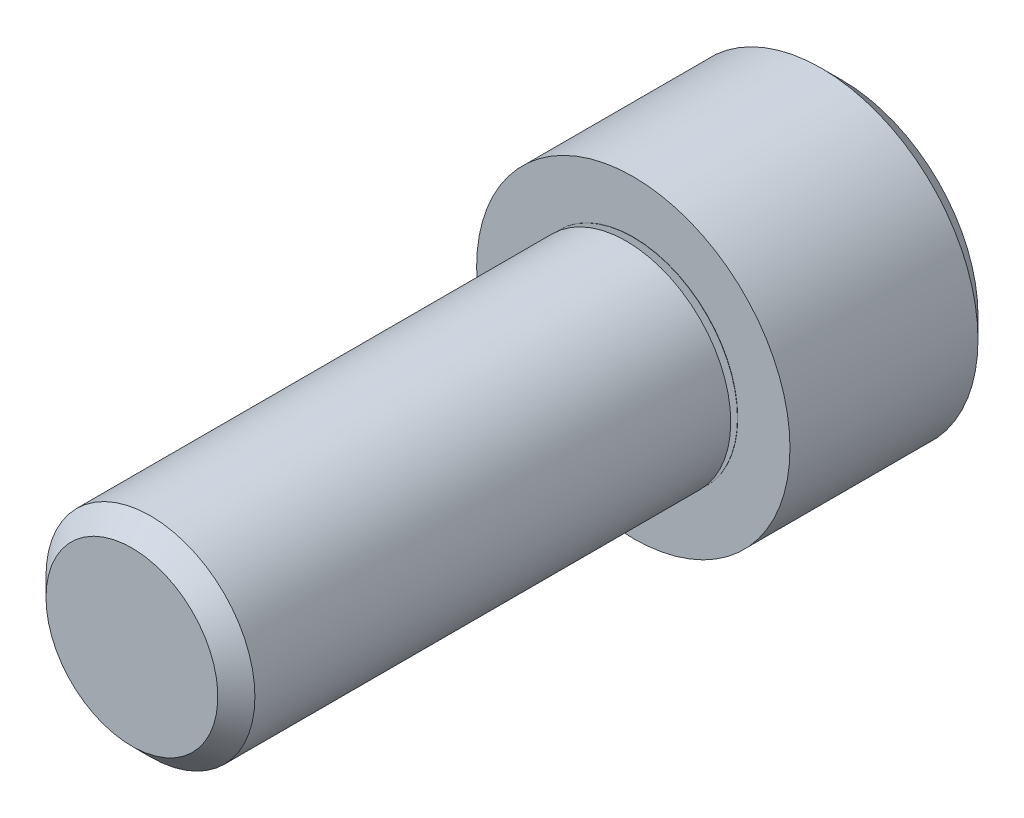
from build123d import *

# Parameters (mm, degrees)
CUT_EXTRUDE1_DEPTH = 3.96875


with BuildPart() as part:
    # Logo3_bib1 → Revolve1 (revolve)
    with BuildSketch(Plane(origin=(0, 0, 0), x_dir=(-1, 0, 0), z_dir=(0, -1, 0))):
        with BuildLine():
            Line((0, -19.05), (0, 7.9375))
            Line((0, 7.9375), (5.159375, 7.9375))
            Line((5.159375, 7.9375), (5.953125, 7.14375))
            Line((5.953125, 7.14375), (5.953125, 0))
            Line((5.953125, 0), (3.96875, 0))
            Line((3.96875, 0), (3.96875, -0.01))
            Line((3.96875, -0.01), (3.377325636, -0.01))
            ThreePointArc((3.377325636, -0.01), (3.357629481, -0.026527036), (3.370485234, -0.048793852))
            Line((3.370485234, -0.048793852), (3.96875, -0.26654442))
            Line((3.96875, -0.26654442), (3.96875, -18.34515))
            Line((3.96875, -18.34515), (3.2639, -19.05))
            Line((3.2639, -19.05), (0, -19.05))
        make_face()
    revolve(axis=Axis((0, 0, -10.585154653), (0, 0, 1)))

    # Logo3_bib2 → Cut-Extrude1 (cut)
    with BuildSketch(Plane(origin=(0, 0, -7.9375), x_dir=(1, 0, 0), z_dir=(0, 0, -1))):
        Polygon((3.666174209, 0), (1.833087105, 3.175), (-1.833087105, 3.175), (-3.666174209, 0), (-1.833087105, -3.175), (1.833087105, -3.175), align=None)
    extrude(amount=-CUT_EXTRUDE1_DEPTH, mode=Mode.SUBTRACT)


solid = part.part
